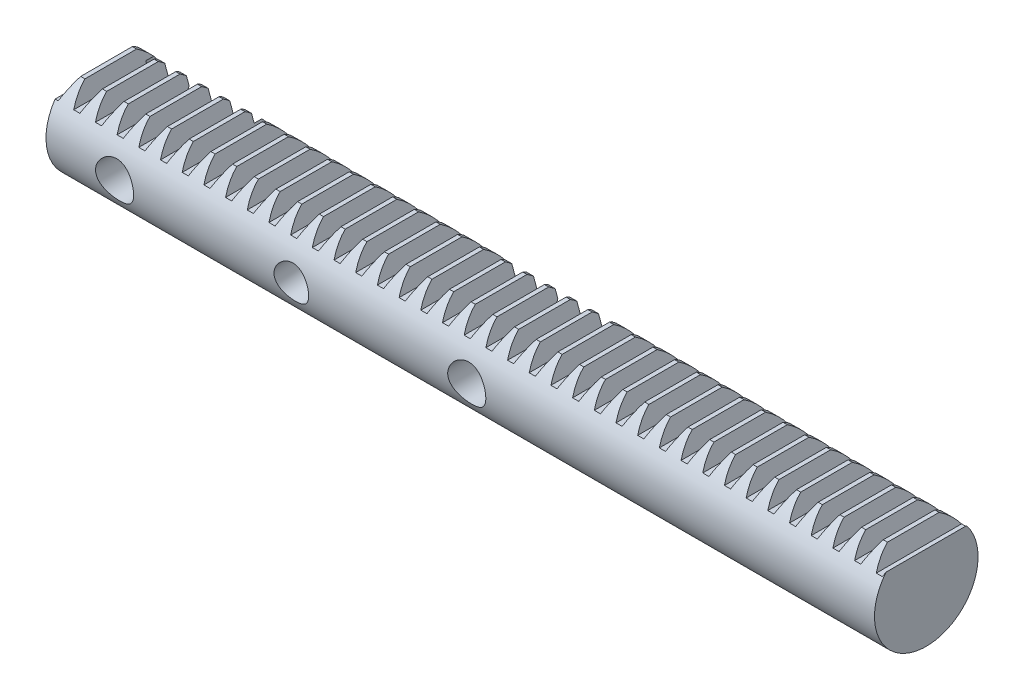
from build123d import *

# Parameters (mm, degrees)
BLANKSKE_W                                           = 120
BLANKSKE_H                                           = 14
BLANK_DEPTH                                          = 15
TOOTHCUTSIM_DEPTH                                    = 122.741529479
TEETHCUTS_COUNT                                      = 39
TEETHCUTS_PITCH                                      = 3.14159265
SKETCH1_OUTSIDE_W                                    = 41.348
SKETCH1_OUTSIDE_H                                    = 40.348
SKETCH1_OUTSIDE_R                                    = 7.5
CUT_EXTRUDE1_DEPTH                                   = 122.741529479
SKETCH2_W                                            = 15.7
SKETCH2_H                                            = 15
CUT_EXTRUDE2_DEPTH                                   = 3
CSK_FOR_M5_HEX_SOCKET_COUNTERSUNK_CAP_SC_D           = 5.5
CSK_FOR_M5_HEX_SOCKET_COUNTERSUNK_CAP_SC_CSINK_D     = 11.2
CSK_FOR_M5_HEX_SOCKET_COUNTERSUNK_CAP_SC_CSINK_ANGLE = 90
F_5_0_5_DIAMETER_HOLE4_D                             = 5
F_5_0_5_DIAMETER_HOLE4_DEPTH                         = 10
F_5_0_5_DIAMETER_HOLE4_TIP                           = 1.502151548


with BuildPart() as part:
    # BlankSke → Blank (new body)
    with BuildSketch(Plane.XY):
        with Locations((60, 7)):
            Rectangle(BLANKSKE_W, BLANKSKE_H)
    extrude(amount=-BLANK_DEPTH)

    # TooCutSkeSim → ToothCutSim (cut, through all)
    with BuildSketch(Plane.XY):
        Polygon((0.44443537, 11.75), (-0.44443537, 11.75), (-1.272613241, 14.0254), (1.272613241, 14.0254), align=None)
    toothcutsim = extrude(amount=-TOOTHCUTSIM_DEPTH, mode=Mode.SUBTRACT)

    # TeethCuts: ToothCutSim ×39
    with Locations(*[(i * TEETHCUTS_PITCH, 0, 0) for i in range(1, TEETHCUTS_COUNT)]):
        add(toothcutsim, mode=Mode.SUBTRACT)

    # Sketch1 outside → Cut-Extrude1 (cut, through all)
    with BuildSketch(Plane(origin=(120, 0, 0), x_dir=(0, 0, -1), z_dir=(1, 0, 0))):
        with Locations((7.5, 7)):
            Rectangle(SKETCH1_OUTSIDE_W, SKETCH1_OUTSIDE_H)
        with Locations((7.5, 7.5)):
            Circle(SKETCH1_OUTSIDE_R, mode=Mode.SUBTRACT)
    extrude(amount=-CUT_EXTRUDE1_DEPTH, mode=Mode.SUBTRACT)

    # Sketch2 → Cut-Extrude2 (cut)
    with BuildSketch(Plane(origin=(0, 0, -15), x_dir=(-1, 0, 0), z_dir=(0, 0, -1))):
        with Locations((-10.3, 7.5)):
            Rectangle(SKETCH2_W, SKETCH2_H)
        with Locations((-60.7, 7.5)):
            Rectangle(SKETCH2_W, SKETCH2_H)
    extrude(amount=-CUT_EXTRUDE2_DEPTH, mode=Mode.SUBTRACT)

    # CSK for M5 Hex Socket Countersunk Cap Sc (through all)
    with Locations(Plane(origin=(0, 0, -12), x_dir=(-1, 0, 0), z_dir=(0, 0, -1))):
        with Locations((-9.911712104, 6.963009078), (-60.920749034, 6.963009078)):
            CounterSinkHole(CSK_FOR_M5_HEX_SOCKET_COUNTERSUNK_CAP_SC_D / 2, CSK_FOR_M5_HEX_SOCKET_COUNTERSUNK_CAP_SC_CSINK_D / 2, counter_sink_angle=CSK_FOR_M5_HEX_SOCKET_COUNTERSUNK_CAP_SC_CSINK_ANGLE)

    # 5.0 _5_ Diameter Hole4
    with Locations(Plane(origin=(35.510212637, 6.939021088, -0.021009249), x_dir=(0, 0.997198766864, 0.07479718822), z_dir=(0, -0.07479718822, 0.997198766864))):
        with Locations((0, 0)):
            Hole(F_5_0_5_DIAMETER_HOLE4_D / 2, depth=F_5_0_5_DIAMETER_HOLE4_DEPTH)
            with Locations((0, 0, -(F_5_0_5_DIAMETER_HOLE4_DEPTH + F_5_0_5_DIAMETER_HOLE4_TIP / 2))):  # 118° drill point
                Cone(0, F_5_0_5_DIAMETER_HOLE4_D / 2, F_5_0_5_DIAMETER_HOLE4_TIP, mode=Mode.SUBTRACT)


solid = part.part
